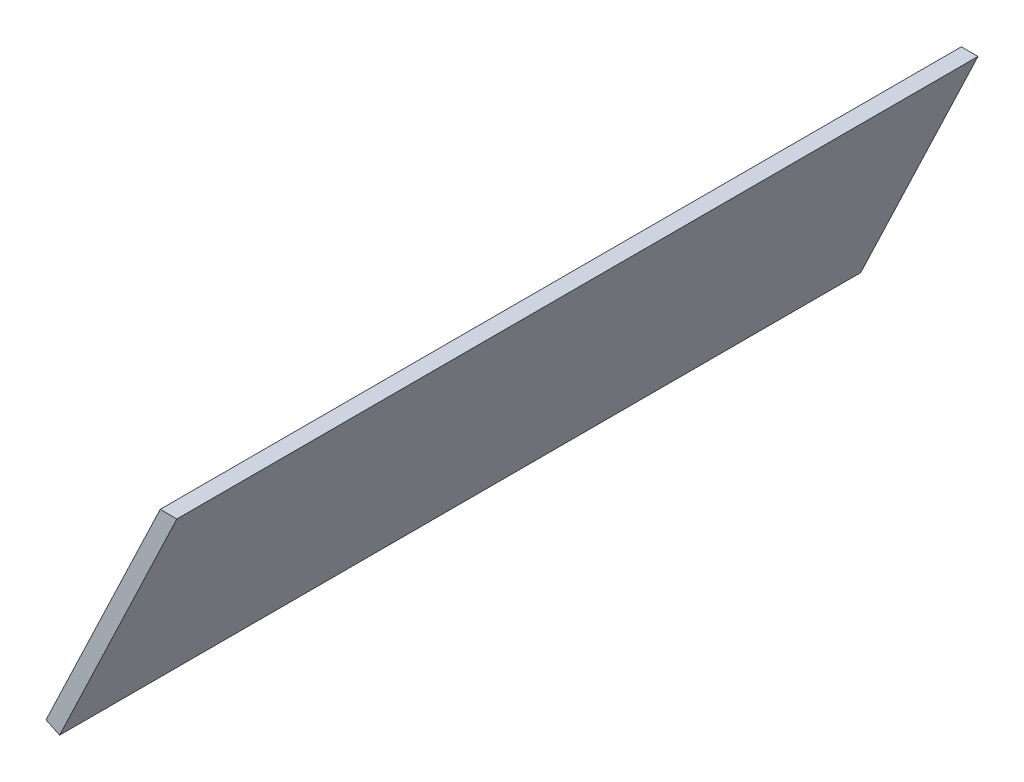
ISO-10303-21;
HEADER;
FILE_DESCRIPTION(('STEP AP214'),'2;1');
FILE_NAME('part.step','',(''),(''),'','','');
FILE_SCHEMA(('AUTOMOTIVE_DESIGN { 1 0 10303 214 1 1 1 1 }'));
ENDSEC;
DATA;
#1=APPLICATION_CONTEXT('core data for automotive mechanical design processes');
#2=APPLICATION_PROTOCOL_DEFINITION('international standard','automotive_design',2000,#1);
#3=PRODUCT_CONTEXT('',#1,'mechanical');
#4=PRODUCT('Part','Part','',(#3));
#5=PRODUCT_RELATED_PRODUCT_CATEGORY('part','',(#4));
#6=PRODUCT_DEFINITION_FORMATION('','',#4);
#7=PRODUCT_DEFINITION_CONTEXT('part definition',#1,'design');
#8=PRODUCT_DEFINITION('design','',#6,#7);
#9=PRODUCT_DEFINITION_SHAPE('','',#8);
#10=(LENGTH_UNIT() NAMED_UNIT(*) SI_UNIT(.MILLI.,.METRE.));
#11=(NAMED_UNIT(*) PLANE_ANGLE_UNIT() SI_UNIT($,.RADIAN.));
#12=(NAMED_UNIT(*) SI_UNIT($,.STERADIAN.) SOLID_ANGLE_UNIT());
#13=UNCERTAINTY_MEASURE_WITH_UNIT(LENGTH_MEASURE(1.E-05),#10,'distance_accuracy_value','');
#14=(GEOMETRIC_REPRESENTATION_CONTEXT(3) GLOBAL_UNCERTAINTY_ASSIGNED_CONTEXT((#13)) GLOBAL_UNIT_ASSIGNED_CONTEXT((#10,
#11,#12)) REPRESENTATION_CONTEXT('',''));
#15=CARTESIAN_POINT('',(0.,0.,0.));
#16=DIRECTION('',(0.,0.,1.));
#17=DIRECTION('',(1.,0.,0.));
#18=AXIS2_PLACEMENT_3D('',#15,#16,#17);
#19=CARTESIAN_POINT('',(69.6840990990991,67.8391666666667,152.4));
#20=DIRECTION('',(0.,-1.,0.));
#21=DIRECTION('',(0.,0.,-1.));
#22=AXIS2_PLACEMENT_3D('',#19,#20,#21);
#23=PLANE('',#22);
#24=DIRECTION('',(-1.,0.,0.));
#25=VECTOR('',#24,1.);
#26=CARTESIAN_POINT('',(69.6840990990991,67.8391666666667,0.));
#27=LINE('',#26,#25);
#28=CARTESIAN_POINT('',(72.8590990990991,67.8391666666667,0.));
#29=VERTEX_POINT('',#28);
#30=CARTESIAN_POINT('',(69.6840990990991,67.8391666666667,0.));
#31=VERTEX_POINT('',#30);
#32=EDGE_CURVE('E100',#29,#31,#27,.T.);
#33=ORIENTED_EDGE('',*,*,#32,.T.);
#34=DIRECTION('',(0.,0.,-1.));
#35=VECTOR('',#34,1.);
#36=CARTESIAN_POINT('',(69.6840990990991,67.8391666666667,152.4));
#37=LINE('',#36,#35);
#38=CARTESIAN_POINT('',(69.6840990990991,67.8391666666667,152.4));
#39=VERTEX_POINT('',#38);
#40=EDGE_CURVE('E11',#39,#31,#37,.T.);
#41=ORIENTED_EDGE('',*,*,#40,.F.);
#42=DIRECTION('',(-1.,0.,0.));
#43=VECTOR('',#42,1.);
#44=CARTESIAN_POINT('',(69.6840990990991,67.8391666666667,152.4));
#45=LINE('',#44,#43);
#46=CARTESIAN_POINT('',(72.8590990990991,67.8391666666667,152.4));
#47=VERTEX_POINT('',#46);
#48=EDGE_CURVE('E88',#47,#39,#45,.T.);
#49=ORIENTED_EDGE('',*,*,#48,.F.);
#50=DIRECTION('',(0.,0.,-1.));
#51=VECTOR('',#50,1.);
#52=CARTESIAN_POINT('',(72.8590990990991,67.8391666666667,152.4));
#53=LINE('',#52,#51);
#54=EDGE_CURVE('E96',#47,#29,#53,.T.);
#55=ORIENTED_EDGE('',*,*,#54,.T.);
#56=EDGE_LOOP('',(#33,#41,#49,#55));
#57=FACE_BOUND('',#56,.T.);
#58=ADVANCED_FACE('F37',(#57),#23,.F.);
#59=CARTESIAN_POINT('',(47.9594959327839,22.2945866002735,152.4));
#60=DIRECTION('',(0.902577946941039,-0.430526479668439,0.));
#61=DIRECTION('',(0.430526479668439,0.902577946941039,0.));
#62=AXIS2_PLACEMENT_3D('',#59,#60,#61);
#63=PLANE('',#62);
#64=DIRECTION('',(-0.430526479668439,-0.902577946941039,0.));
#65=VECTOR('',#64,1.);
#66=CARTESIAN_POINT('',(47.9594959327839,22.2945866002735,0.));
#67=LINE('',#66,#65);
#68=CARTESIAN_POINT('',(47.9594959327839,22.2945866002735,0.));
#69=VERTEX_POINT('',#68);
#70=EDGE_CURVE('E92',#31,#69,#67,.T.);
#71=ORIENTED_EDGE('',*,*,#70,.T.);
#72=DIRECTION('',(0.,0.,-1.));
#73=VECTOR('',#72,1.);
#74=CARTESIAN_POINT('',(47.9594959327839,22.2945866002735,152.4));
#75=LINE('',#74,#73);
#76=CARTESIAN_POINT('',(47.9594959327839,22.2945866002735,152.4));
#77=VERTEX_POINT('',#76);
#78=EDGE_CURVE('E45',#77,#69,#75,.T.);
#79=ORIENTED_EDGE('',*,*,#78,.F.);
#80=DIRECTION('',(-0.430526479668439,-0.902577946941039,0.));
#81=VECTOR('',#80,1.);
#82=CARTESIAN_POINT('',(47.9594959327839,22.2945866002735,152.4));
#83=LINE('',#82,#81);
#84=EDGE_CURVE('E83',#39,#77,#83,.T.);
#85=ORIENTED_EDGE('',*,*,#84,.F.);
#86=ORIENTED_EDGE('',*,*,#40,.T.);
#87=EDGE_LOOP('',(#71,#79,#85,#86));
#88=FACE_BOUND('',#87,.T.);
#89=ADVANCED_FACE('F91',(#88),#63,.F.);
#90=CARTESIAN_POINT('',(50.546,21.0608333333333,152.4));
#91=DIRECTION('',(0.430526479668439,0.902577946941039,0.));
#92=DIRECTION('',(-0.902577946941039,0.430526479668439,0.));
#93=AXIS2_PLACEMENT_3D('',#90,#91,#92);
#94=PLANE('',#93);
#95=DIRECTION('',(0.902577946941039,-0.430526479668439,0.));
#96=VECTOR('',#95,1.);
#97=CARTESIAN_POINT('',(50.546,21.0608333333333,0.));
#98=LINE('',#97,#96);
#99=CARTESIAN_POINT('',(50.546,21.0608333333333,0.));
#100=VERTEX_POINT('',#99);
#101=EDGE_CURVE('E70',#69,#100,#98,.T.);
#102=ORIENTED_EDGE('',*,*,#101,.T.);
#103=DIRECTION('',(0.,0.,-1.));
#104=VECTOR('',#103,1.);
#105=CARTESIAN_POINT('',(50.546,21.0608333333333,152.4));
#106=LINE('',#105,#104);
#107=CARTESIAN_POINT('',(50.546,21.0608333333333,152.4));
#108=VERTEX_POINT('',#107);
#109=EDGE_CURVE('E93',#108,#100,#106,.T.);
#110=ORIENTED_EDGE('',*,*,#109,.F.);
#111=DIRECTION('',(0.902577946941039,-0.430526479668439,0.));
#112=VECTOR('',#111,1.);
#113=CARTESIAN_POINT('',(50.546,21.0608333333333,152.4));
#114=LINE('',#113,#112);
#115=EDGE_CURVE('E86',#77,#108,#114,.T.);
#116=ORIENTED_EDGE('',*,*,#115,.F.);
#117=ORIENTED_EDGE('',*,*,#78,.T.);
#118=EDGE_LOOP('',(#102,#110,#116,#117));
#119=FACE_BOUND('',#118,.T.);
#120=ADVANCED_FACE('F94',(#119),#94,.F.);
#121=CARTESIAN_POINT('',(72.8590990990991,67.8391666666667,152.4));
#122=DIRECTION('',(-0.902577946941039,0.430526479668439,0.));
#123=DIRECTION('',(-0.430526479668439,-0.902577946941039,0.));
#124=AXIS2_PLACEMENT_3D('',#121,#122,#123);
#125=PLANE('',#124);
#126=DIRECTION('',(0.430526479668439,0.902577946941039,0.));
#127=VECTOR('',#126,1.);
#128=CARTESIAN_POINT('',(72.8590990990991,67.8391666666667,0.));
#129=LINE('',#128,#127);
#130=EDGE_CURVE('E76',#100,#29,#129,.T.);
#131=ORIENTED_EDGE('',*,*,#130,.T.);
#132=ORIENTED_EDGE('',*,*,#54,.F.);
#133=DIRECTION('',(0.430526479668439,0.902577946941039,0.));
#134=VECTOR('',#133,1.);
#135=CARTESIAN_POINT('',(72.8590990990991,67.8391666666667,152.4));
#136=LINE('',#135,#134);
#137=EDGE_CURVE('E53',#108,#47,#136,.T.);
#138=ORIENTED_EDGE('',*,*,#137,.F.);
#139=ORIENTED_EDGE('',*,*,#109,.T.);
#140=EDGE_LOOP('',(#131,#132,#138,#139));
#141=FACE_BOUND('',#140,.T.);
#142=ADVANCED_FACE('F107',(#141),#125,.F.);
#143=CARTESIAN_POINT('',(0.,0.,152.4));
#144=DIRECTION('',(0.,0.,-1.));
#145=DIRECTION('',(-1.,0.,0.));
#146=AXIS2_PLACEMENT_3D('',#143,#144,#145);
#147=PLANE('',#146);
#148=ORIENTED_EDGE('',*,*,#48,.T.);
#149=ORIENTED_EDGE('',*,*,#84,.T.);
#150=ORIENTED_EDGE('',*,*,#115,.T.);
#151=ORIENTED_EDGE('',*,*,#137,.T.);
#152=EDGE_LOOP('',(#148,#149,#150,#151));
#153=FACE_BOUND('',#152,.T.);
#154=ADVANCED_FACE('F84',(#153),#147,.F.);
#155=CARTESIAN_POINT('',(0.,0.,0.));
#156=DIRECTION('',(0.,0.,-1.));
#157=DIRECTION('',(-1.,0.,0.));
#158=AXIS2_PLACEMENT_3D('',#155,#156,#157);
#159=PLANE('',#158);
#160=ORIENTED_EDGE('',*,*,#32,.F.);
#161=ORIENTED_EDGE('',*,*,#130,.F.);
#162=ORIENTED_EDGE('',*,*,#101,.F.);
#163=ORIENTED_EDGE('',*,*,#70,.F.);
#164=EDGE_LOOP('',(#160,#161,#162,#163));
#165=FACE_BOUND('',#164,.T.);
#166=ADVANCED_FACE('F110',(#165),#159,.T.);
#167=CLOSED_SHELL('',(#58,#89,#120,#142,#154,#166));
#168=MANIFOLD_SOLID_BREP('B2',#167);
#169=ADVANCED_BREP_SHAPE_REPRESENTATION('',(#18,#168),#14);
#170=SHAPE_DEFINITION_REPRESENTATION(#9,#169);
ENDSEC;
END-ISO-10303-21;
